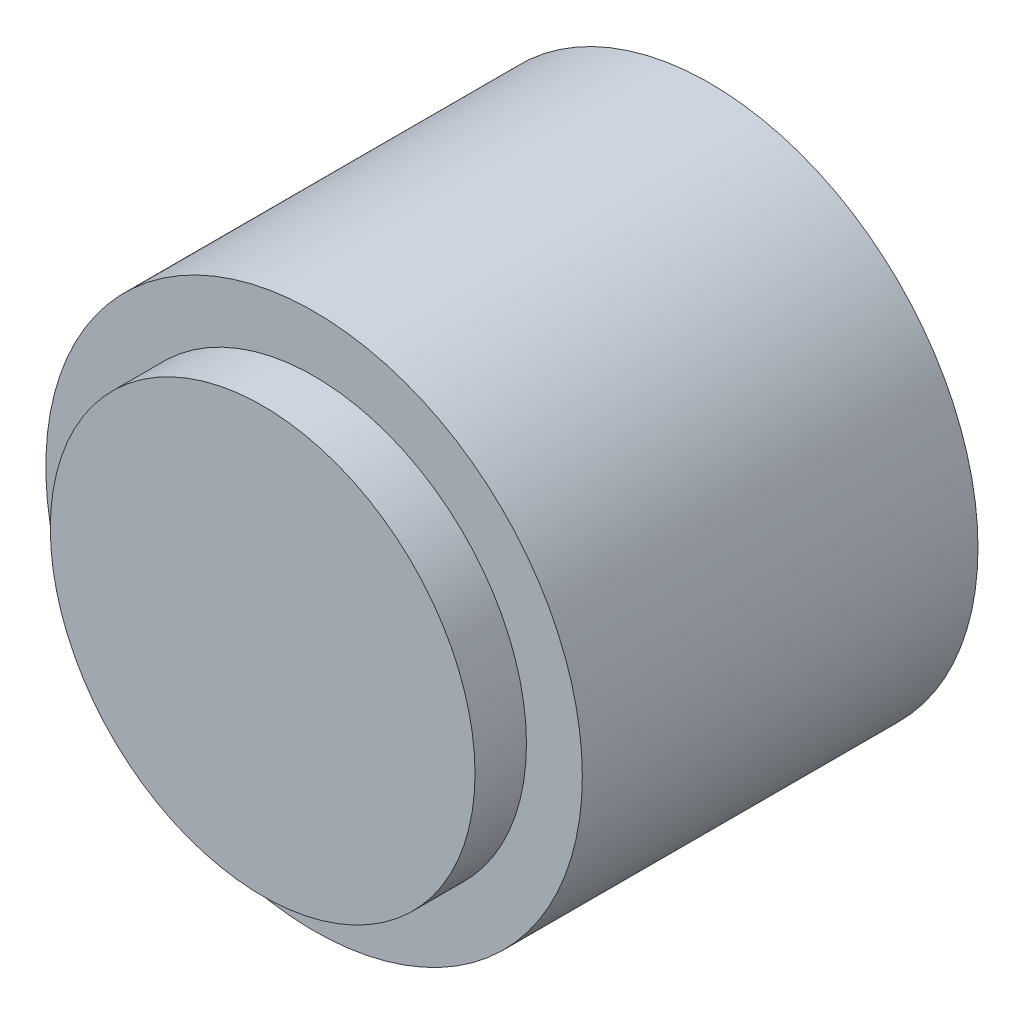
ISO-10303-21;
HEADER;
FILE_DESCRIPTION(('STEP AP214'),'2;1');
FILE_NAME('part.step','',(''),(''),'','','');
FILE_SCHEMA(('AUTOMOTIVE_DESIGN { 1 0 10303 214 1 1 1 1 }'));
ENDSEC;
DATA;
#1=APPLICATION_CONTEXT('core data for automotive mechanical design processes');
#2=APPLICATION_PROTOCOL_DEFINITION('international standard','automotive_design',2000,#1);
#3=PRODUCT_CONTEXT('',#1,'mechanical');
#4=PRODUCT('Part','Part','',(#3));
#5=PRODUCT_RELATED_PRODUCT_CATEGORY('part','',(#4));
#6=PRODUCT_DEFINITION_FORMATION('','',#4);
#7=PRODUCT_DEFINITION_CONTEXT('part definition',#1,'design');
#8=PRODUCT_DEFINITION('design','',#6,#7);
#9=PRODUCT_DEFINITION_SHAPE('','',#8);
#10=(LENGTH_UNIT() NAMED_UNIT(*) SI_UNIT(.MILLI.,.METRE.));
#11=(NAMED_UNIT(*) PLANE_ANGLE_UNIT() SI_UNIT($,.RADIAN.));
#12=(NAMED_UNIT(*) SI_UNIT($,.STERADIAN.) SOLID_ANGLE_UNIT());
#13=UNCERTAINTY_MEASURE_WITH_UNIT(LENGTH_MEASURE(1.E-05),#10,'distance_accuracy_value','');
#14=(GEOMETRIC_REPRESENTATION_CONTEXT(3) GLOBAL_UNCERTAINTY_ASSIGNED_CONTEXT((#13)) GLOBAL_UNIT_ASSIGNED_CONTEXT((#10,
#11,#12)) REPRESENTATION_CONTEXT('',''));
#15=CARTESIAN_POINT('',(0.,0.,0.));
#16=DIRECTION('',(0.,0.,1.));
#17=DIRECTION('',(1.,0.,0.));
#18=AXIS2_PLACEMENT_3D('',#15,#16,#17);
#19=CARTESIAN_POINT('',(0.,0.,30.));
#20=DIRECTION('',(0.,0.,1.));
#21=DIRECTION('',(1.,0.,0.));
#22=AXIS2_PLACEMENT_3D('',#19,#20,#21);
#23=CYLINDRICAL_SURFACE('',#22,6.);
#24=CARTESIAN_POINT('',(0.,0.,0.));
#25=DIRECTION('',(0.,0.,1.));
#26=DIRECTION('',(1.,0.,0.));
#27=AXIS2_PLACEMENT_3D('',#24,#25,#26);
#28=CIRCLE('',#27,6.);
#29=CARTESIAN_POINT('',(6.,0.,0.));
#30=VERTEX_POINT('',#29);
#31=EDGE_CURVE('E8',#30,#30,#28,.T.);
#32=ORIENTED_EDGE('',*,*,#31,.T.);
#33=EDGE_LOOP('',(#32));
#34=FACE_BOUND('',#33,.T.);
#35=CARTESIAN_POINT('',(0.,0.,8.85));
#36=DIRECTION('',(0.,0.,1.));
#37=DIRECTION('',(1.,0.,0.));
#38=AXIS2_PLACEMENT_3D('',#35,#36,#37);
#39=CIRCLE('',#38,6.);
#40=CARTESIAN_POINT('',(6.,0.,8.85));
#41=VERTEX_POINT('',#40);
#42=EDGE_CURVE('E28',#41,#41,#39,.T.);
#43=ORIENTED_EDGE('',*,*,#42,.F.);
#44=EDGE_LOOP('',(#43));
#45=FACE_BOUND('',#44,.T.);
#46=ADVANCED_FACE('F12',(#34,#45),#23,.T.);
#47=CARTESIAN_POINT('',(2.5,0.,0.));
#48=DIRECTION('',(0.,0.,1.));
#49=DIRECTION('',(1.,0.,0.));
#50=AXIS2_PLACEMENT_3D('',#47,#48,#49);
#51=PLANE('',#50);
#52=ORIENTED_EDGE('',*,*,#31,.F.);
#53=EDGE_LOOP('',(#52));
#54=FACE_BOUND('',#53,.T.);
#55=CARTESIAN_POINT('',(0.,0.,0.));
#56=DIRECTION('',(0.,0.,1.));
#57=DIRECTION('',(1.,0.,0.));
#58=AXIS2_PLACEMENT_3D('',#55,#56,#57);
#59=CIRCLE('',#58,2.5);
#60=CARTESIAN_POINT('',(2.5,0.,0.));
#61=VERTEX_POINT('',#60);
#62=EDGE_CURVE('E19',#61,#61,#59,.T.);
#63=ORIENTED_EDGE('',*,*,#62,.T.);
#64=EDGE_LOOP('',(#63));
#65=FACE_BOUND('',#64,.T.);
#66=ADVANCED_FACE('F41',(#54,#65),#51,.F.);
#67=CARTESIAN_POINT('',(0.,0.,30.));
#68=DIRECTION('',(0.,0.,1.));
#69=DIRECTION('',(1.,0.,0.));
#70=AXIS2_PLACEMENT_3D('',#67,#68,#69);
#71=CYLINDRICAL_SURFACE('',#70,2.5);
#72=CARTESIAN_POINT('',(0.,0.,6.));
#73=DIRECTION('',(0.,0.,-1.));
#74=DIRECTION('',(-1.,0.,0.));
#75=AXIS2_PLACEMENT_3D('',#72,#73,#74);
#76=CIRCLE('',#75,2.5);
#77=CARTESIAN_POINT('',(-2.5,0.,6.));
#78=VERTEX_POINT('',#77);
#79=EDGE_CURVE('E31',#78,#78,#76,.T.);
#80=ORIENTED_EDGE('',*,*,#79,.F.);
#81=EDGE_LOOP('',(#80));
#82=FACE_BOUND('',#81,.T.);
#83=ORIENTED_EDGE('',*,*,#62,.F.);
#84=EDGE_LOOP('',(#83));
#85=FACE_BOUND('',#84,.T.);
#86=ADVANCED_FACE('F37',(#82,#85),#71,.F.);
#87=CARTESIAN_POINT('',(0.,0.,20.));
#88=DIRECTION('',(0.,0.,1.));
#89=DIRECTION('',(1.,0.,0.));
#90=AXIS2_PLACEMENT_3D('',#87,#88,#89);
#91=CYLINDRICAL_SURFACE('',#90,4.75);
#92=CARTESIAN_POINT('',(0.,0.,8.85));
#93=DIRECTION('',(0.,0.,1.));
#94=DIRECTION('',(1.,0.,0.));
#95=AXIS2_PLACEMENT_3D('',#92,#93,#94);
#96=CIRCLE('',#95,4.75);
#97=CARTESIAN_POINT('',(4.75,0.,8.85));
#98=VERTEX_POINT('',#97);
#99=EDGE_CURVE('E25',#98,#98,#96,.T.);
#100=ORIENTED_EDGE('',*,*,#99,.T.);
#101=EDGE_LOOP('',(#100));
#102=FACE_BOUND('',#101,.T.);
#103=CARTESIAN_POINT('',(0.,0.,10.));
#104=DIRECTION('',(0.,0.,-1.));
#105=DIRECTION('',(-1.,0.,0.));
#106=AXIS2_PLACEMENT_3D('',#103,#104,#105);
#107=CIRCLE('',#106,4.75);
#108=CARTESIAN_POINT('',(-4.75,0.,10.));
#109=VERTEX_POINT('',#108);
#110=EDGE_CURVE('E15',#109,#109,#107,.T.);
#111=ORIENTED_EDGE('',*,*,#110,.T.);
#112=EDGE_LOOP('',(#111));
#113=FACE_BOUND('',#112,.T.);
#114=ADVANCED_FACE('F40',(#102,#113),#91,.T.);
#115=CARTESIAN_POINT('',(-4.75,0.,8.85));
#116=DIRECTION('',(0.,0.,1.));
#117=DIRECTION('',(1.,0.,0.));
#118=AXIS2_PLACEMENT_3D('',#115,#116,#117);
#119=PLANE('',#118);
#120=ORIENTED_EDGE('',*,*,#42,.T.);
#121=EDGE_LOOP('',(#120));
#122=FACE_BOUND('',#121,.T.);
#123=ORIENTED_EDGE('',*,*,#99,.F.);
#124=EDGE_LOOP('',(#123));
#125=FACE_BOUND('',#124,.T.);
#126=ADVANCED_FACE('F56',(#122,#125),#119,.T.);
#127=CARTESIAN_POINT('',(6.,0.,10.));
#128=DIRECTION('',(0.,0.,-1.));
#129=DIRECTION('',(-1.,0.,0.));
#130=AXIS2_PLACEMENT_3D('',#127,#128,#129);
#131=PLANE('',#130);
#132=ORIENTED_EDGE('',*,*,#110,.F.);
#133=EDGE_LOOP('',(#132));
#134=FACE_BOUND('',#133,.T.);
#135=ADVANCED_FACE('F53',(#134),#131,.F.);
#136=CARTESIAN_POINT('',(0.,0.,6.));
#137=DIRECTION('',(0.,0.,-1.));
#138=DIRECTION('',(-1.,0.,0.));
#139=AXIS2_PLACEMENT_3D('',#136,#137,#138);
#140=PLANE('',#139);
#141=ORIENTED_EDGE('',*,*,#79,.T.);
#142=EDGE_LOOP('',(#141));
#143=FACE_BOUND('',#142,.T.);
#144=ADVANCED_FACE('F35',(#143),#140,.T.);
#145=CLOSED_SHELL('',(#46,#66,#86,#114,#126,#135,#144));
#146=MANIFOLD_SOLID_BREP('B1',#145);
#147=ADVANCED_BREP_SHAPE_REPRESENTATION('',(#18,#146),#14);
#148=SHAPE_DEFINITION_REPRESENTATION(#9,#147);
ENDSEC;
END-ISO-10303-21;
